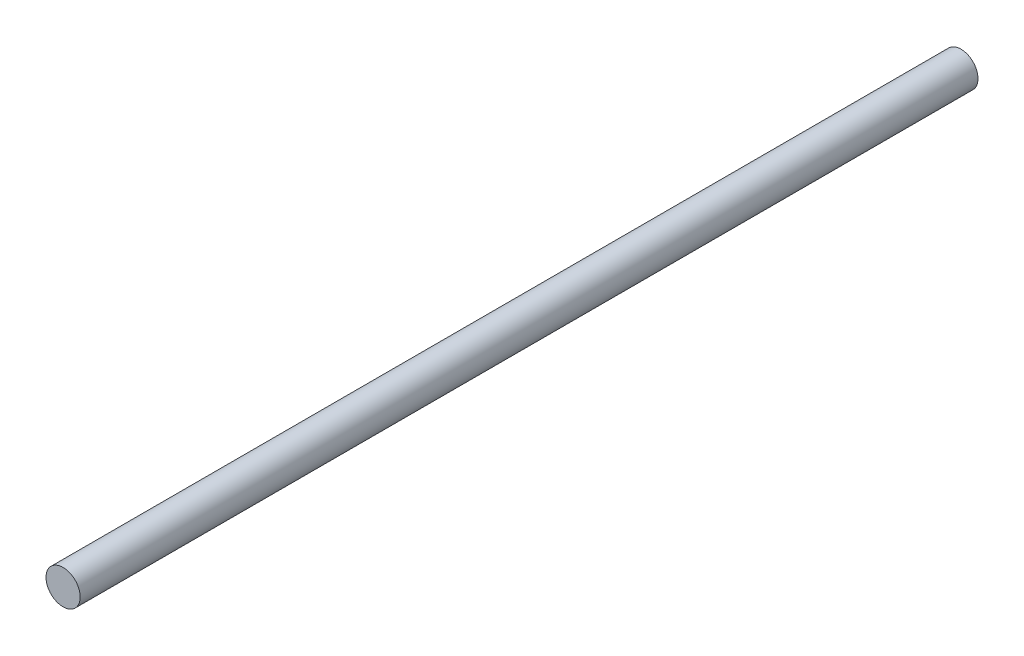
ISO-10303-21;
HEADER;
FILE_DESCRIPTION(('STEP AP214'),'2;1');
FILE_NAME('part.step','',(''),(''),'','','');
FILE_SCHEMA(('AUTOMOTIVE_DESIGN { 1 0 10303 214 1 1 1 1 }'));
ENDSEC;
DATA;
#1=APPLICATION_CONTEXT('core data for automotive mechanical design processes');
#2=APPLICATION_PROTOCOL_DEFINITION('international standard','automotive_design',2000,#1);
#3=PRODUCT_CONTEXT('',#1,'mechanical');
#4=PRODUCT('Part','Part','',(#3));
#5=PRODUCT_RELATED_PRODUCT_CATEGORY('part','',(#4));
#6=PRODUCT_DEFINITION_FORMATION('','',#4);
#7=PRODUCT_DEFINITION_CONTEXT('part definition',#1,'design');
#8=PRODUCT_DEFINITION('design','',#6,#7);
#9=PRODUCT_DEFINITION_SHAPE('','',#8);
#10=(LENGTH_UNIT() NAMED_UNIT(*) SI_UNIT(.MILLI.,.METRE.));
#11=(NAMED_UNIT(*) PLANE_ANGLE_UNIT() SI_UNIT($,.RADIAN.));
#12=(NAMED_UNIT(*) SI_UNIT($,.STERADIAN.) SOLID_ANGLE_UNIT());
#13=UNCERTAINTY_MEASURE_WITH_UNIT(LENGTH_MEASURE(1.E-05),#10,'distance_accuracy_value','');
#14=(GEOMETRIC_REPRESENTATION_CONTEXT(3) GLOBAL_UNCERTAINTY_ASSIGNED_CONTEXT((#13)) GLOBAL_UNIT_ASSIGNED_CONTEXT((#10,
#11,#12)) REPRESENTATION_CONTEXT('',''));
#15=CARTESIAN_POINT('',(0.,0.,0.));
#16=DIRECTION('',(0.,0.,1.));
#17=DIRECTION('',(1.,0.,0.));
#18=AXIS2_PLACEMENT_3D('',#15,#16,#17);
#19=CARTESIAN_POINT('',(0.,0.,57.7838190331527));
#20=DIRECTION('',(0.,0.,1.));
#21=DIRECTION('',(1.,0.,0.));
#22=AXIS2_PLACEMENT_3D('',#19,#20,#21);
#23=PLANE('',#22);
#24=CARTESIAN_POINT('',(0.,0.,57.7838190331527));
#25=DIRECTION('',(0.,0.,-1.));
#26=DIRECTION('',(-1.,0.,0.));
#27=AXIS2_PLACEMENT_3D('',#24,#25,#26);
#28=CIRCLE('',#27,2.2);
#29=CARTESIAN_POINT('',(-2.2,0.,57.7838190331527));
#30=VERTEX_POINT('',#29);
#31=EDGE_CURVE('E10',#30,#30,#28,.T.);
#32=ORIENTED_EDGE('',*,*,#31,.F.);
#33=EDGE_LOOP('',(#32));
#34=FACE_BOUND('',#33,.T.);
#35=ADVANCED_FACE('F15',(#34),#23,.T.);
#36=CARTESIAN_POINT('',(0.,0.,-57.7838190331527));
#37=DIRECTION('',(0.,0.,-1.));
#38=DIRECTION('',(-1.,0.,0.));
#39=AXIS2_PLACEMENT_3D('',#36,#37,#38);
#40=PLANE('',#39);
#41=CARTESIAN_POINT('',(0.,0.,-57.7838190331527));
#42=DIRECTION('',(0.,0.,1.));
#43=DIRECTION('',(1.,0.,0.));
#44=AXIS2_PLACEMENT_3D('',#41,#42,#43);
#45=CIRCLE('',#44,2.2);
#46=CARTESIAN_POINT('',(2.2,0.,-57.7838190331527));
#47=VERTEX_POINT('',#46);
#48=EDGE_CURVE('E22',#47,#47,#45,.T.);
#49=ORIENTED_EDGE('',*,*,#48,.F.);
#50=EDGE_LOOP('',(#49));
#51=FACE_BOUND('',#50,.T.);
#52=ADVANCED_FACE('F26',(#51),#40,.T.);
#53=CARTESIAN_POINT('',(0.,0.,-57.7838190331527));
#54=DIRECTION('',(0.,0.,1.));
#55=DIRECTION('',(1.,0.,0.));
#56=AXIS2_PLACEMENT_3D('',#53,#54,#55);
#57=CYLINDRICAL_SURFACE('',#56,2.2);
#58=ORIENTED_EDGE('',*,*,#31,.T.);
#59=EDGE_LOOP('',(#58));
#60=FACE_BOUND('',#59,.T.);
#61=ORIENTED_EDGE('',*,*,#48,.T.);
#62=EDGE_LOOP('',(#61));
#63=FACE_BOUND('',#62,.T.);
#64=ADVANCED_FACE('F17',(#60,#63),#57,.T.);
#65=CLOSED_SHELL('',(#35,#52,#64));
#66=MANIFOLD_SOLID_BREP('B1',#65);
#67=ADVANCED_BREP_SHAPE_REPRESENTATION('',(#18,#66),#14);
#68=SHAPE_DEFINITION_REPRESENTATION(#9,#67);
ENDSEC;
END-ISO-10303-21;
